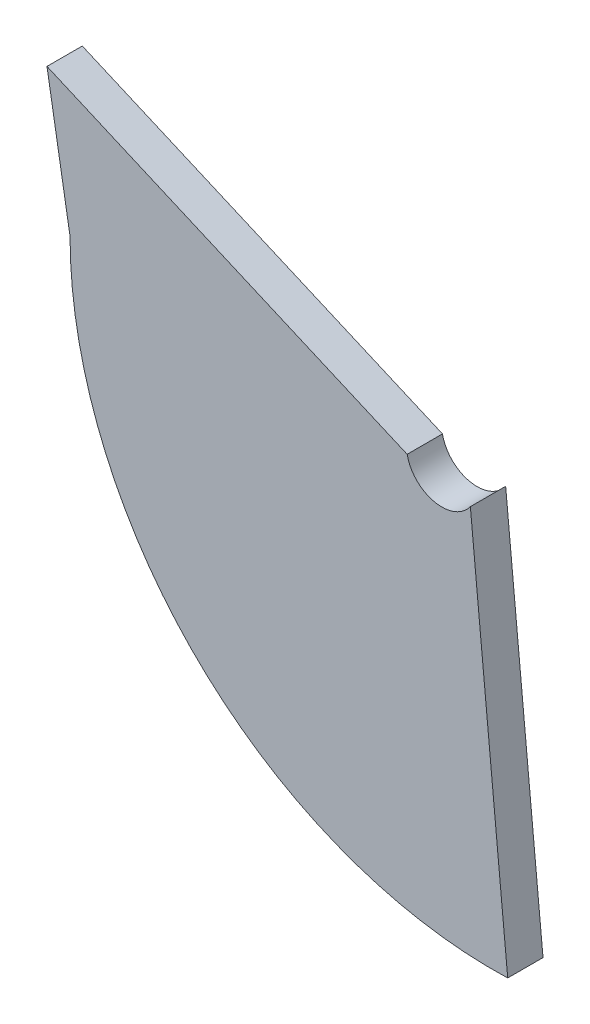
ISO-10303-21;
HEADER;
FILE_DESCRIPTION(('STEP AP214'),'2;1');
FILE_NAME('part.step','',(''),(''),'','','');
FILE_SCHEMA(('AUTOMOTIVE_DESIGN { 1 0 10303 214 1 1 1 1 }'));
ENDSEC;
DATA;
#1=APPLICATION_CONTEXT('core data for automotive mechanical design processes');
#2=APPLICATION_PROTOCOL_DEFINITION('international standard','automotive_design',2000,#1);
#3=PRODUCT_CONTEXT('',#1,'mechanical');
#4=PRODUCT('Part','Part','',(#3));
#5=PRODUCT_RELATED_PRODUCT_CATEGORY('part','',(#4));
#6=PRODUCT_DEFINITION_FORMATION('','',#4);
#7=PRODUCT_DEFINITION_CONTEXT('part definition',#1,'design');
#8=PRODUCT_DEFINITION('design','',#6,#7);
#9=PRODUCT_DEFINITION_SHAPE('','',#8);
#10=(LENGTH_UNIT() NAMED_UNIT(*) SI_UNIT(.MILLI.,.METRE.));
#11=(NAMED_UNIT(*) PLANE_ANGLE_UNIT() SI_UNIT($,.RADIAN.));
#12=(NAMED_UNIT(*) SI_UNIT($,.STERADIAN.) SOLID_ANGLE_UNIT());
#13=UNCERTAINTY_MEASURE_WITH_UNIT(LENGTH_MEASURE(1.E-05),#10,'distance_accuracy_value','');
#14=(GEOMETRIC_REPRESENTATION_CONTEXT(3) GLOBAL_UNCERTAINTY_ASSIGNED_CONTEXT((#13)) GLOBAL_UNIT_ASSIGNED_CONTEXT((#10,
#11,#12)) REPRESENTATION_CONTEXT('',''));
#15=CARTESIAN_POINT('',(0.,0.,0.));
#16=DIRECTION('',(0.,0.,1.));
#17=DIRECTION('',(1.,0.,0.));
#18=AXIS2_PLACEMENT_3D('',#15,#16,#17);
#19=CARTESIAN_POINT('',(278.673928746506,247.25710520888,25.4));
#20=DIRECTION('',(0.,0.,-1.));
#21=DIRECTION('',(-1.,0.,0.));
#22=AXIS2_PLACEMENT_3D('',#19,#20,#21);
#23=CYLINDRICAL_SURFACE('',#22,304.8);
#24=CARTESIAN_POINT('',(278.673928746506,247.25710520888,0.));
#25=DIRECTION('',(0.,0.,1.));
#26=DIRECTION('',(1.,0.,0.));
#27=AXIS2_PLACEMENT_3D('',#24,#25,#26);
#28=CIRCLE('',#27,304.8);
#29=CARTESIAN_POINT('',(-26.1260712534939,247.25710520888,0.));
#30=VERTEX_POINT('',#29);
#31=CARTESIAN_POINT('',(288.747113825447,-57.3763974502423,0.));
#32=VERTEX_POINT('',#31);
#33=EDGE_CURVE('E116',#30,#32,#28,.T.);
#34=ORIENTED_EDGE('',*,*,#33,.T.);
#35=DIRECTION('',(0.,0.,-1.));
#36=VECTOR('',#35,1.);
#37=CARTESIAN_POINT('',(288.747113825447,-57.3763974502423,25.4));
#38=LINE('',#37,#36);
#39=CARTESIAN_POINT('',(288.747113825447,-57.3763974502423,25.4));
#40=VERTEX_POINT('',#39);
#41=EDGE_CURVE('E11',#40,#32,#38,.T.);
#42=ORIENTED_EDGE('',*,*,#41,.F.);
#43=CARTESIAN_POINT('',(278.673928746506,247.25710520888,25.4));
#44=DIRECTION('',(0.,0.,1.));
#45=DIRECTION('',(1.,0.,0.));
#46=AXIS2_PLACEMENT_3D('',#43,#44,#45);
#47=CIRCLE('',#46,304.8);
#48=CARTESIAN_POINT('',(-26.1260712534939,247.25710520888,25.4));
#49=VERTEX_POINT('',#48);
#50=EDGE_CURVE('E128',#49,#40,#47,.T.);
#51=ORIENTED_EDGE('',*,*,#50,.F.);
#52=DIRECTION('',(0.,0.,-1.));
#53=VECTOR('',#52,1.);
#54=CARTESIAN_POINT('',(-26.1260712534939,247.25710520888,25.4));
#55=LINE('',#54,#53);
#56=EDGE_CURVE('E112',#49,#30,#55,.T.);
#57=ORIENTED_EDGE('',*,*,#56,.T.);
#58=EDGE_LOOP('',(#34,#42,#51,#57));
#59=FACE_BOUND('',#58,.T.);
#60=ADVANCED_FACE('F38',(#59),#23,.T.);
#61=CARTESIAN_POINT('',(288.747113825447,-57.3763974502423,25.4));
#62=DIRECTION('',(-0.995434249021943,-0.0954497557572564,0.));
#63=DIRECTION('',(0.0954497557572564,-0.995434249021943,0.));
#64=AXIS2_PLACEMENT_3D('',#61,#62,#63);
#65=PLANE('',#64);
#66=DIRECTION('',(-0.0954497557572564,0.995434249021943,0.));
#67=VECTOR('',#66,1.);
#68=CARTESIAN_POINT('',(288.747113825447,-57.3763974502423,0.));
#69=LINE('',#68,#67);
#70=CARTESIAN_POINT('',(261.875870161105,222.860634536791,0.));
#71=VERTEX_POINT('',#70);
#72=EDGE_CURVE('E120',#32,#71,#69,.T.);
#73=ORIENTED_EDGE('',*,*,#72,.T.);
#74=DIRECTION('',(0.,0.,-1.));
#75=VECTOR('',#74,1.);
#76=CARTESIAN_POINT('',(261.875870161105,222.860634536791,25.4));
#77=LINE('',#76,#75);
#78=CARTESIAN_POINT('',(261.875870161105,222.860634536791,25.4));
#79=VERTEX_POINT('',#78);
#80=EDGE_CURVE('E47',#79,#71,#77,.T.);
#81=ORIENTED_EDGE('',*,*,#80,.F.);
#82=DIRECTION('',(-0.0954497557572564,0.995434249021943,0.));
#83=VECTOR('',#82,1.);
#84=CARTESIAN_POINT('',(288.747113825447,-57.3763974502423,25.4));
#85=LINE('',#84,#83);
#86=EDGE_CURVE('E92',#40,#79,#85,.T.);
#87=ORIENTED_EDGE('',*,*,#86,.F.);
#88=ORIENTED_EDGE('',*,*,#41,.T.);
#89=EDGE_LOOP('',(#73,#81,#87,#88));
#90=FACE_BOUND('',#89,.T.);
#91=ADVANCED_FACE('F148',(#90),#65,.F.);
#92=CARTESIAN_POINT('',(241.309242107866,237.76613052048,25.4));
#93=DIRECTION('',(0.,0.,-1.));
#94=DIRECTION('',(-1.,0.,0.));
#95=AXIS2_PLACEMENT_3D('',#92,#93,#94);
#96=CYLINDRICAL_SURFACE('',#95,25.4);
#97=CARTESIAN_POINT('',(241.309242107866,237.76613052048,0.));
#98=DIRECTION('',(0.,0.,-1.));
#99=DIRECTION('',(1.,0.,0.));
#100=AXIS2_PLACEMENT_3D('',#97,#98,#99);
#101=CIRCLE('',#100,25.4);
#102=CARTESIAN_POINT('',(216.408285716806,232.755903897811,0.));
#103=VERTEX_POINT('',#102);
#104=EDGE_CURVE('E107',#71,#103,#101,.T.);
#105=ORIENTED_EDGE('',*,*,#104,.T.);
#106=DIRECTION('',(0.,0.,-1.));
#107=VECTOR('',#106,1.);
#108=CARTESIAN_POINT('',(216.408285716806,232.755903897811,25.4));
#109=LINE('',#108,#107);
#110=CARTESIAN_POINT('',(216.408285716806,232.755903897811,25.4));
#111=VERTEX_POINT('',#110);
#112=EDGE_CURVE('E104',#111,#103,#109,.T.);
#113=ORIENTED_EDGE('',*,*,#112,.F.);
#114=CARTESIAN_POINT('',(241.309242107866,237.76613052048,25.4));
#115=DIRECTION('',(0.,0.,-1.));
#116=DIRECTION('',(1.,0.,0.));
#117=AXIS2_PLACEMENT_3D('',#114,#115,#116);
#118=CIRCLE('',#117,25.4);
#119=EDGE_CURVE('E96',#79,#111,#118,.T.);
#120=ORIENTED_EDGE('',*,*,#119,.F.);
#121=ORIENTED_EDGE('',*,*,#80,.T.);
#122=EDGE_LOOP('',(#105,#113,#120,#121));
#123=FACE_BOUND('',#122,.T.);
#124=ADVANCED_FACE('F105',(#123),#96,.F.);
#125=CARTESIAN_POINT('',(-42.7121050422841,344.866254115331,25.4));
#126=DIRECTION('',(-0.39708507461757,-0.91778180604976,0.));
#127=DIRECTION('',(0.91778180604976,-0.39708507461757,0.));
#128=AXIS2_PLACEMENT_3D('',#125,#126,#127);
#129=PLANE('',#128);
#130=DIRECTION('',(-0.91778180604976,0.39708507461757,0.));
#131=VECTOR('',#130,1.);
#132=CARTESIAN_POINT('',(-42.7121050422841,344.866254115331,0.));
#133=LINE('',#132,#131);
#134=CARTESIAN_POINT('',(-42.7121050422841,344.866254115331,0.));
#135=VERTEX_POINT('',#134);
#136=EDGE_CURVE('E77',#103,#135,#133,.T.);
#137=ORIENTED_EDGE('',*,*,#136,.T.);
#138=DIRECTION('',(0.,0.,-1.));
#139=VECTOR('',#138,1.);
#140=CARTESIAN_POINT('',(-42.7121050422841,344.866254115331,25.4));
#141=LINE('',#140,#139);
#142=CARTESIAN_POINT('',(-42.7121050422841,344.866254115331,25.4));
#143=VERTEX_POINT('',#142);
#144=EDGE_CURVE('E108',#143,#135,#141,.T.);
#145=ORIENTED_EDGE('',*,*,#144,.F.);
#146=DIRECTION('',(-0.91778180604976,0.39708507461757,0.));
#147=VECTOR('',#146,1.);
#148=CARTESIAN_POINT('',(-42.7121050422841,344.866254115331,25.4));
#149=LINE('',#148,#147);
#150=EDGE_CURVE('E100',#111,#143,#149,.T.);
#151=ORIENTED_EDGE('',*,*,#150,.F.);
#152=ORIENTED_EDGE('',*,*,#112,.T.);
#153=EDGE_LOOP('',(#137,#145,#151,#152));
#154=FACE_BOUND('',#153,.T.);
#155=ADVANCED_FACE('F110',(#154),#129,.F.);
#156=CARTESIAN_POINT('',(-42.7121050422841,344.866254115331,25.4));
#157=DIRECTION('',(0.985868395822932,0.167521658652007,0.));
#158=DIRECTION('',(-0.167521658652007,0.985868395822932,0.));
#159=AXIS2_PLACEMENT_3D('',#156,#157,#158);
#160=PLANE('',#159);
#161=DIRECTION('',(0.167521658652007,-0.985868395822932,0.));
#162=VECTOR('',#161,1.);
#163=CARTESIAN_POINT('',(-42.7121050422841,344.866254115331,0.));
#164=LINE('',#163,#162);
#165=EDGE_CURVE('E83',#135,#30,#164,.T.);
#166=ORIENTED_EDGE('',*,*,#165,.T.);
#167=ORIENTED_EDGE('',*,*,#56,.F.);
#168=DIRECTION('',(0.167521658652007,-0.985868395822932,0.));
#169=VECTOR('',#168,1.);
#170=CARTESIAN_POINT('',(-42.7121050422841,344.866254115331,25.4));
#171=LINE('',#170,#169);
#172=EDGE_CURVE('E55',#143,#49,#171,.T.);
#173=ORIENTED_EDGE('',*,*,#172,.F.);
#174=ORIENTED_EDGE('',*,*,#144,.T.);
#175=EDGE_LOOP('',(#166,#167,#173,#174));
#176=FACE_BOUND('',#175,.T.);
#177=ADVANCED_FACE('F137',(#176),#160,.F.);
#178=CARTESIAN_POINT('',(278.673928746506,247.25710520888,25.4));
#179=DIRECTION('',(0.,0.,1.));
#180=DIRECTION('',(1.,0.,0.));
#181=AXIS2_PLACEMENT_3D('',#178,#179,#180);
#182=PLANE('',#181);
#183=ORIENTED_EDGE('',*,*,#50,.T.);
#184=ORIENTED_EDGE('',*,*,#86,.T.);
#185=ORIENTED_EDGE('',*,*,#119,.T.);
#186=ORIENTED_EDGE('',*,*,#150,.T.);
#187=ORIENTED_EDGE('',*,*,#172,.T.);
#188=EDGE_LOOP('',(#183,#184,#185,#186,#187));
#189=FACE_BOUND('',#188,.T.);
#190=ADVANCED_FACE('F98',(#189),#182,.T.);
#191=CARTESIAN_POINT('',(278.673928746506,247.25710520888,0.));
#192=DIRECTION('',(0.,0.,1.));
#193=DIRECTION('',(1.,0.,0.));
#194=AXIS2_PLACEMENT_3D('',#191,#192,#193);
#195=PLANE('',#194);
#196=ORIENTED_EDGE('',*,*,#33,.F.);
#197=ORIENTED_EDGE('',*,*,#165,.F.);
#198=ORIENTED_EDGE('',*,*,#136,.F.);
#199=ORIENTED_EDGE('',*,*,#104,.F.);
#200=ORIENTED_EDGE('',*,*,#72,.F.);
#201=EDGE_LOOP('',(#196,#197,#198,#199,#200));
#202=FACE_BOUND('',#201,.T.);
#203=ADVANCED_FACE('F133',(#202),#195,.F.);
#204=CLOSED_SHELL('',(#60,#91,#124,#155,#177,#190,#203));
#205=MANIFOLD_SOLID_BREP('B2',#204);
#206=ADVANCED_BREP_SHAPE_REPRESENTATION('',(#18,#205),#14);
#207=SHAPE_DEFINITION_REPRESENTATION(#9,#206);
ENDSEC;
END-ISO-10303-21;
